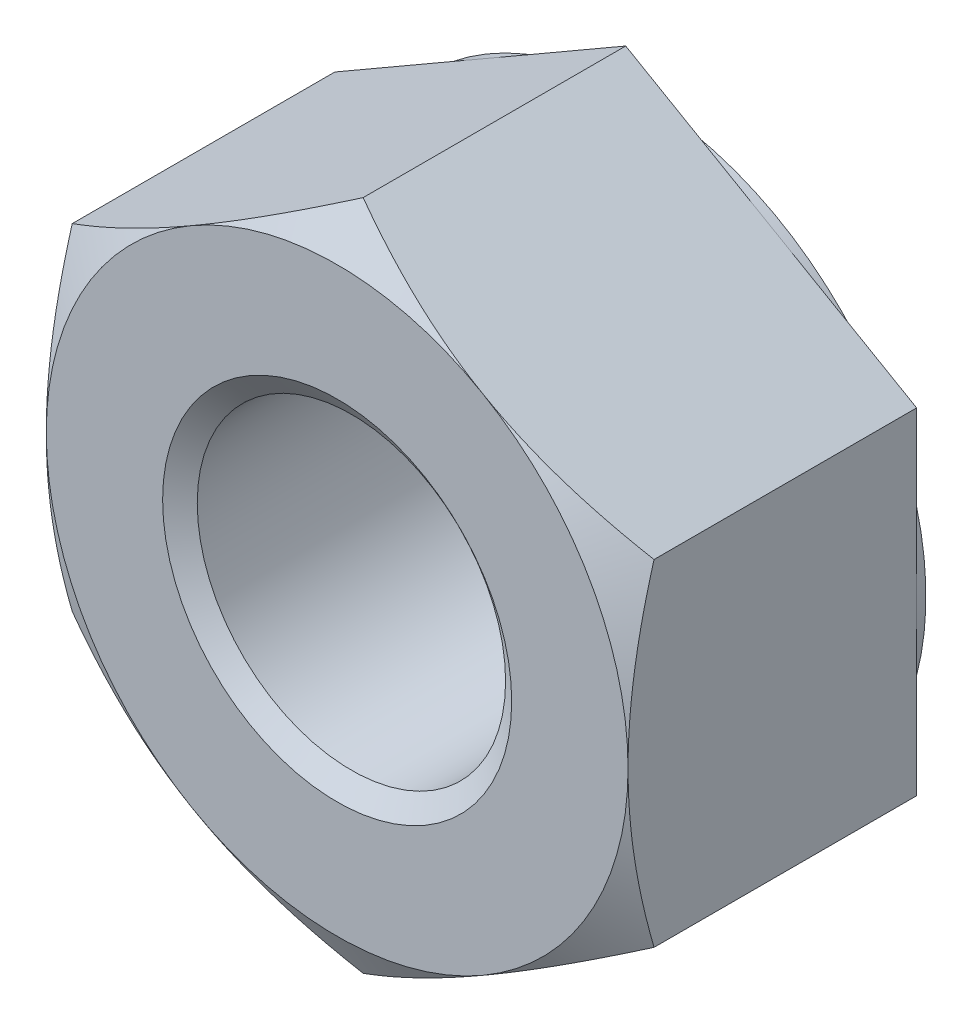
ISO-10303-21;
HEADER;
FILE_DESCRIPTION(('STEP AP214'),'2;1');
FILE_NAME('part.step','',(''),(''),'','','');
FILE_SCHEMA(('AUTOMOTIVE_DESIGN { 1 0 10303 214 1 1 1 1 }'));
ENDSEC;
DATA;
#1=APPLICATION_CONTEXT('core data for automotive mechanical design processes');
#2=APPLICATION_PROTOCOL_DEFINITION('international standard','automotive_design',2000,#1);
#3=PRODUCT_CONTEXT('',#1,'mechanical');
#4=PRODUCT('Part','Part','',(#3));
#5=PRODUCT_RELATED_PRODUCT_CATEGORY('part','',(#4));
#6=PRODUCT_DEFINITION_FORMATION('','',#4);
#7=PRODUCT_DEFINITION_CONTEXT('part definition',#1,'design');
#8=PRODUCT_DEFINITION('design','',#6,#7);
#9=PRODUCT_DEFINITION_SHAPE('','',#8);
#10=(LENGTH_UNIT() NAMED_UNIT(*) SI_UNIT(.MILLI.,.METRE.));
#11=(NAMED_UNIT(*) PLANE_ANGLE_UNIT() SI_UNIT($,.RADIAN.));
#12=(NAMED_UNIT(*) SI_UNIT($,.STERADIAN.) SOLID_ANGLE_UNIT());
#13=UNCERTAINTY_MEASURE_WITH_UNIT(LENGTH_MEASURE(1.E-05),#10,'distance_accuracy_value','');
#14=(GEOMETRIC_REPRESENTATION_CONTEXT(3) GLOBAL_UNCERTAINTY_ASSIGNED_CONTEXT((#13)) GLOBAL_UNIT_ASSIGNED_CONTEXT((#10,
#11,#12)) REPRESENTATION_CONTEXT('',''));
#15=CARTESIAN_POINT('',(0.,0.,0.));
#16=DIRECTION('',(0.,0.,1.));
#17=DIRECTION('',(1.,0.,0.));
#18=AXIS2_PLACEMENT_3D('',#15,#16,#17);
#19=CARTESIAN_POINT('',(0.,0.,-25.6));
#20=DIRECTION('',(0.,0.,1.));
#21=DIRECTION('',(1.,0.,0.));
#22=AXIS2_PLACEMENT_3D('',#19,#20,#21);
#23=CYLINDRICAL_SURFACE('',#22,13.25);
#24=CARTESIAN_POINT('',(0.,0.,-1.22536319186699));
#25=DIRECTION('',(0.,0.,1.));
#26=DIRECTION('',(1.,0.,0.));
#27=AXIS2_PLACEMENT_3D('',#24,#25,#26);
#28=CIRCLE('',#27,13.25);
#29=CARTESIAN_POINT('',(13.25,0.,-1.22536319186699));
#30=VERTEX_POINT('',#29);
#31=EDGE_CURVE('E149',#30,#30,#28,.F.);
#32=ORIENTED_EDGE('',*,*,#31,.F.);
#33=EDGE_LOOP('',(#32));
#34=FACE_BOUND('',#33,.T.);
#35=CARTESIAN_POINT('',(0.,0.,-24.349236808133));
#36=DIRECTION('',(0.,0.,-1.));
#37=DIRECTION('',(-1.,0.,0.));
#38=AXIS2_PLACEMENT_3D('',#35,#36,#37);
#39=CIRCLE('',#38,13.25);
#40=CARTESIAN_POINT('',(-13.25,0.,-24.349236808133));
#41=VERTEX_POINT('',#40);
#42=EDGE_CURVE('E37',#41,#41,#39,.F.);
#43=ORIENTED_EDGE('',*,*,#42,.F.);
#44=EDGE_LOOP('',(#43));
#45=FACE_BOUND('',#44,.T.);
#46=ADVANCED_FACE('F32',(#34,#45),#23,.F.);
#47=CARTESIAN_POINT('',(0.,28.8675134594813,-25.6));
#48=DIRECTION('',(0.,0.,-1.));
#49=DIRECTION('',(-1.,0.,0.));
#50=AXIS2_PLACEMENT_3D('',#47,#48,#49);
#51=PLANE('',#50);
#52=CARTESIAN_POINT('',(0.,0.,-25.6));
#53=DIRECTION('',(0.,0.,-1.));
#54=DIRECTION('',(-1.,0.,0.));
#55=AXIS2_PLACEMENT_3D('',#52,#53,#54);
#56=CIRCLE('',#55,25.);
#57=CARTESIAN_POINT('',(-25.,0.,-25.6));
#58=VERTEX_POINT('',#57);
#59=EDGE_CURVE('E276',#58,#58,#56,.F.);
#60=ORIENTED_EDGE('',*,*,#59,.F.);
#61=EDGE_LOOP('',(#60));
#62=FACE_BOUND('',#61,.T.);
#63=CARTESIAN_POINT('',(0.,0.,-25.6));
#64=DIRECTION('',(0.,0.,-1.));
#65=DIRECTION('',(-1.,0.,0.));
#66=AXIS2_PLACEMENT_3D('',#63,#64,#65);
#67=CIRCLE('',#66,15.);
#68=CARTESIAN_POINT('',(-15.,0.,-25.6));
#69=VERTEX_POINT('',#68);
#70=EDGE_CURVE('E296',#69,#69,#67,.F.);
#71=ORIENTED_EDGE('',*,*,#70,.T.);
#72=EDGE_LOOP('',(#71));
#73=FACE_BOUND('',#72,.T.);
#74=ADVANCED_FACE('F228',(#62,#73),#51,.T.);
#75=CARTESIAN_POINT('',(0.,28.8675134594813,0.));
#76=DIRECTION('',(0.,0.,-1.));
#77=DIRECTION('',(-1.,0.,0.));
#78=AXIS2_PLACEMENT_3D('',#75,#76,#77);
#79=PLANE('',#78);
#80=CARTESIAN_POINT('',(0.,0.,0.));
#81=DIRECTION('',(0.,0.,-1.));
#82=DIRECTION('',(-1.,0.,0.));
#83=AXIS2_PLACEMENT_3D('',#80,#81,#82);
#84=CIRCLE('',#83,25.);
#85=CARTESIAN_POINT('',(-12.5,21.650635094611,0.));
#86=VERTEX_POINT('',#85);
#87=CARTESIAN_POINT('',(-25.,0.,0.));
#88=VERTEX_POINT('',#87);
#89=EDGE_CURVE('E44',#86,#88,#84,.F.);
#90=ORIENTED_EDGE('',*,*,#89,.T.);
#91=CARTESIAN_POINT('',(-12.5,-21.650635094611,0.));
#92=VERTEX_POINT('',#91);
#93=EDGE_CURVE('E12',#88,#92,#84,.F.);
#94=ORIENTED_EDGE('',*,*,#93,.T.);
#95=CARTESIAN_POINT('',(12.5,-21.650635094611,0.));
#96=VERTEX_POINT('',#95);
#97=EDGE_CURVE('E42',#92,#96,#84,.F.);
#98=ORIENTED_EDGE('',*,*,#97,.T.);
#99=CARTESIAN_POINT('',(25.,0.,0.));
#100=VERTEX_POINT('',#99);
#101=EDGE_CURVE('E128',#96,#100,#84,.F.);
#102=ORIENTED_EDGE('',*,*,#101,.T.);
#103=CARTESIAN_POINT('',(0.,0.,0.));
#104=DIRECTION('',(0.,0.,1.));
#105=DIRECTION('',(1.,0.,0.));
#106=AXIS2_PLACEMENT_3D('',#103,#104,#105);
#107=CIRCLE('',#106,25.);
#108=CARTESIAN_POINT('',(12.5,21.650635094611,0.));
#109=VERTEX_POINT('',#108);
#110=EDGE_CURVE('E140',#100,#109,#107,.T.);
#111=ORIENTED_EDGE('',*,*,#110,.T.);
#112=EDGE_CURVE('E155',#109,#86,#84,.F.);
#113=ORIENTED_EDGE('',*,*,#112,.T.);
#114=EDGE_LOOP('',(#90,#94,#98,#102,#111,#113));
#115=FACE_BOUND('',#114,.T.);
#116=CARTESIAN_POINT('',(0.,0.,0.));
#117=DIRECTION('',(0.,0.,1.));
#118=DIRECTION('',(1.,0.,0.));
#119=AXIS2_PLACEMENT_3D('',#116,#117,#118);
#120=CIRCLE('',#119,15.);
#121=CARTESIAN_POINT('',(15.,0.,0.));
#122=VERTEX_POINT('',#121);
#123=EDGE_CURVE('E295',#122,#122,#120,.T.);
#124=ORIENTED_EDGE('',*,*,#123,.F.);
#125=EDGE_LOOP('',(#124));
#126=FACE_BOUND('',#125,.T.);
#127=ADVANCED_FACE('F152',(#115,#126),#79,.F.);
#128=CARTESIAN_POINT('',(0.,28.8675134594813,-25.6));
#129=DIRECTION('',(-0.500000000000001,0.866025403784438,0.));
#130=DIRECTION('',(-0.866025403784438,-0.500000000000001,0.));
#131=AXIS2_PLACEMENT_3D('',#128,#129,#130);
#132=PLANE('',#131);
#133=DIRECTION('',(0.,0.,1.));
#134=VECTOR('',#133,1.);
#135=CARTESIAN_POINT('',(-25.,14.4337567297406,-25.6));
#136=LINE('',#135,#134);
#137=CARTESIAN_POINT('',(-25.,14.4337567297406,-24.8));
#138=VERTEX_POINT('',#137);
#139=CARTESIAN_POINT('',(-25.,14.4337567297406,-2.23290993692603));
#140=VERTEX_POINT('',#139);
#141=EDGE_CURVE('E285',#138,#140,#136,.T.);
#142=ORIENTED_EDGE('',*,*,#141,.T.);
#143=CARTESIAN_POINT('',(-25.0002,14.4336412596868,-2.23297660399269));
#144=CARTESIAN_POINT('',(-24.4507109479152,14.7508889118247,-2.04982704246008));
#145=CARTESIAN_POINT('',(-23.8990785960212,15.0693739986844,-1.87498859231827));
#146=CARTESIAN_POINT('',(-22.7913904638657,15.7088980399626,-1.54424409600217));
#147=CARTESIAN_POINT('',(-22.2353332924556,16.029937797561,-1.38834427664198));
#148=CARTESIAN_POINT('',(-21.1177090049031,16.6751984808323,-1.09756958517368));
#149=CARTESIAN_POINT('',(-20.5561320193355,16.9994251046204,-0.962744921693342));
#150=CARTESIAN_POINT('',(-19.4290997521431,17.6501174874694,-0.717024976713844));
#151=CARTESIAN_POINT('',(-18.8636448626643,17.9765830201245,-0.606127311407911));
#152=CARTESIAN_POINT('',(-17.7433102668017,18.6234085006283,-0.412968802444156));
#153=CARTESIAN_POINT('',(-17.1885136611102,18.9437204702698,-0.330069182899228));
#154=CARTESIAN_POINT('',(-16.0763783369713,19.5858120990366,-0.191065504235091));
#155=CARTESIAN_POINT('',(-15.5190395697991,19.9075917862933,-0.134961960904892));
#156=CARTESIAN_POINT('',(-14.4034258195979,20.5516916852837,-0.0509670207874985));
#157=CARTESIAN_POINT('',(-13.8451527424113,20.8740107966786,-0.0230421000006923));
#158=CARTESIAN_POINT('',(-12.7280914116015,21.518946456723,0.00399507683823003));
#159=CARTESIAN_POINT('',(-12.1693031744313,21.8415629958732,0.00310822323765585));
#160=CARTESIAN_POINT('',(-11.1246404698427,22.4446992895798,-0.0254657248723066));
#161=CARTESIAN_POINT('',(-10.6386915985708,22.725262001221,-0.0496684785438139));
#162=CARTESIAN_POINT('',(-9.66795399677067,23.2857176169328,-0.119404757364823));
#163=CARTESIAN_POINT('',(-9.18316524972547,23.5656105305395,-0.164937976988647));
#164=CARTESIAN_POINT('',(-8.21492701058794,24.1246231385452,-0.276546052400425));
#165=CARTESIAN_POINT('',(-7.73147912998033,24.4037419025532,-0.342639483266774));
#166=CARTESIAN_POINT('',(-6.76689819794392,24.9606429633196,-0.494198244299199));
#167=CARTESIAN_POINT('',(-6.28576513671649,25.2384252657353,-0.579663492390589));
#168=CARTESIAN_POINT('',(-4.8251476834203,26.0817131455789,-0.867310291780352));
#169=CARTESIAN_POINT('',(-3.84981315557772,26.6448227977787,-1.09818903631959));
#170=CARTESIAN_POINT('',(-2.3975824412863,27.4832685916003,-1.49124920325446));
#171=CARTESIAN_POINT('',(-1.91571684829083,27.7614738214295,-1.62991816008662));
#172=CARTESIAN_POINT('',(-0.955318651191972,28.3159599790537,-1.92129458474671));
#173=CARTESIAN_POINT('',(-0.476785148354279,28.5922414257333,-2.07399809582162));
#174=CARTESIAN_POINT('',(0.000200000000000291,28.8676289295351,-2.2329766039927));
#175=B_SPLINE_CURVE_WITH_KNOTS('',3,(#143,#144,#145,#146,#147,#148,#149,#150,#151,#152,#153,
#154,#155,#156,#157,#158,#159,#160,#161,#162,#163,#164,#165,#166,#167,#168,#169,#170,#171,#172,
#173,#174),.UNSPECIFIED.,.F.,.F.,(4,2,2,2,2,2,2,2,2,2,2,2,2,2,2,4),(0.,1.98125159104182,
3.9631528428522,5.94970601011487,7.93606116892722,9.87343019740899,11.8108365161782,
13.7459351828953,15.6809740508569,17.3655086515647,19.0500191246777,20.7360559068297,
22.4220855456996,25.8684114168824,27.588572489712,29.3082500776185),.UNSPECIFIED.);
#176=EDGE_CURVE('E56',#140,#86,#175,.T.);
#177=ORIENTED_EDGE('',*,*,#176,.T.);
#178=CARTESIAN_POINT('',(0.,28.8675134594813,-2.23290993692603));
#179=VERTEX_POINT('',#178);
#180=EDGE_CURVE('E164',#86,#179,#175,.T.);
#181=ORIENTED_EDGE('',*,*,#180,.T.);
#182=DIRECTION('',(0.,0.,1.));
#183=VECTOR('',#182,1.);
#184=CARTESIAN_POINT('',(0.,28.8675134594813,-25.6));
#185=LINE('',#184,#183);
#186=CARTESIAN_POINT('',(0.,28.8675134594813,-24.8));
#187=VERTEX_POINT('',#186);
#188=EDGE_CURVE('E273',#187,#179,#185,.T.);
#189=ORIENTED_EDGE('',*,*,#188,.F.);
#190=DIRECTION('',(-0.866025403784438,-0.500000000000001,0.));
#191=VECTOR('',#190,1.);
#192=CARTESIAN_POINT('',(0.,28.8675134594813,-24.8));
#193=LINE('',#192,#191);
#194=CARTESIAN_POINT('',(-12.5,21.650635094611,-24.8));
#195=VERTEX_POINT('',#194);
#196=EDGE_CURVE('E261',#187,#195,#193,.T.);
#197=ORIENTED_EDGE('',*,*,#196,.T.);
#198=EDGE_CURVE('E257',#195,#138,#193,.T.);
#199=ORIENTED_EDGE('',*,*,#198,.T.);
#200=EDGE_LOOP('',(#142,#177,#181,#189,#197,#199));
#201=FACE_BOUND('',#200,.T.);
#202=ADVANCED_FACE('F34',(#201),#132,.T.);
#203=CARTESIAN_POINT('',(25.,14.4337567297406,-25.6));
#204=DIRECTION('',(0.500000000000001,0.866025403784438,0.));
#205=DIRECTION('',(-0.866025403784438,0.500000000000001,0.));
#206=AXIS2_PLACEMENT_3D('',#203,#204,#205);
#207=PLANE('',#206);
#208=ORIENTED_EDGE('',*,*,#188,.T.);
#209=CARTESIAN_POINT('',(-0.00020000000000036,28.8676289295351,-2.2329766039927));
#210=CARTESIAN_POINT('',(0.54928905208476,28.5503812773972,-2.04982704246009));
#211=CARTESIAN_POINT('',(1.10092140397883,28.2318961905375,-1.87498859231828));
#212=CARTESIAN_POINT('',(2.20860953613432,27.5923721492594,-1.54424409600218));
#213=CARTESIAN_POINT('',(2.76466670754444,27.2713323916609,-1.38834427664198));
#214=CARTESIAN_POINT('',(3.88229099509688,26.6260717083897,-1.09756958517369));
#215=CARTESIAN_POINT('',(4.44386798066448,26.3018450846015,-0.96274492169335));
#216=CARTESIAN_POINT('',(5.57090024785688,25.6511527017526,-0.71702497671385));
#217=CARTESIAN_POINT('',(6.13635513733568,25.3246871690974,-0.606127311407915));
#218=CARTESIAN_POINT('',(7.25668973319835,24.6778616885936,-0.412968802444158));
#219=CARTESIAN_POINT('',(7.81148633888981,24.3575497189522,-0.33006918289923));
#220=CARTESIAN_POINT('',(8.92362166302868,23.7154580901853,-0.191065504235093));
#221=CARTESIAN_POINT('',(9.48096043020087,23.3936784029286,-0.134961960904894));
#222=CARTESIAN_POINT('',(10.5965741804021,22.7495785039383,-0.0509670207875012));
#223=CARTESIAN_POINT('',(11.1548472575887,22.4272593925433,-0.0230421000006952));
#224=CARTESIAN_POINT('',(12.2719085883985,21.7823237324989,0.00399507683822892));
#225=CARTESIAN_POINT('',(12.8306968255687,21.4597071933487,0.00310822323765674));
#226=CARTESIAN_POINT('',(13.8753595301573,20.8565708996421,-0.0254657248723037));
#227=CARTESIAN_POINT('',(14.3613084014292,20.5760081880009,-0.0496684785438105));
#228=CARTESIAN_POINT('',(15.3320460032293,20.0155525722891,-0.11940475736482));
#229=CARTESIAN_POINT('',(15.8168347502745,19.7356596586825,-0.164937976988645));
#230=CARTESIAN_POINT('',(16.7850729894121,19.1766470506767,-0.276546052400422));
#231=CARTESIAN_POINT('',(17.2685208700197,18.8975282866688,-0.342639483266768));
#232=CARTESIAN_POINT('',(18.2331018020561,18.3406272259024,-0.494198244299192));
#233=CARTESIAN_POINT('',(18.7142348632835,18.0628449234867,-0.579663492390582));
#234=CARTESIAN_POINT('',(20.1748523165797,17.219557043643,-0.867310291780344));
#235=CARTESIAN_POINT('',(21.1501868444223,16.6564473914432,-1.09818903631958));
#236=CARTESIAN_POINT('',(22.6024175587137,15.8180015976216,-1.49124920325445));
#237=CARTESIAN_POINT('',(23.0842831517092,15.5397963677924,-1.62991816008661));
#238=CARTESIAN_POINT('',(24.044681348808,14.9853102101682,-1.92129458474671));
#239=CARTESIAN_POINT('',(24.5232148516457,14.7090287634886,-2.07399809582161));
#240=CARTESIAN_POINT('',(25.0002,14.4336412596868,-2.23297660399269));
#241=B_SPLINE_CURVE_WITH_KNOTS('',3,(#209,#210,#211,#212,#213,#214,#215,#216,#217,#218,#219,
#220,#221,#222,#223,#224,#225,#226,#227,#228,#229,#230,#231,#232,#233,#234,#235,#236,#237,#238,
#239,#240),.UNSPECIFIED.,.F.,.F.,(4,2,2,2,2,2,2,2,2,2,2,2,2,2,2,4),(0.,1.98125159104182,
3.96315284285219,5.94970601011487,7.93606116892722,9.873430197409,11.8108365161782,
13.7459351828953,15.6809740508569,17.3655086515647,19.0500191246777,20.7360559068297,
22.4220855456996,25.8684114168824,27.588572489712,29.3082500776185),.UNSPECIFIED.);
#242=EDGE_CURVE('E161',#179,#109,#241,.T.);
#243=ORIENTED_EDGE('',*,*,#242,.T.);
#244=CARTESIAN_POINT('',(25.,14.4337567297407,-2.23290993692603));
#245=VERTEX_POINT('',#244);
#246=EDGE_CURVE('E143',#109,#245,#241,.T.);
#247=ORIENTED_EDGE('',*,*,#246,.T.);
#248=DIRECTION('',(0.,0.,1.));
#249=VECTOR('',#248,1.);
#250=CARTESIAN_POINT('',(25.,14.4337567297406,-25.6));
#251=LINE('',#250,#249);
#252=CARTESIAN_POINT('',(25.,14.4337567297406,-24.8));
#253=VERTEX_POINT('',#252);
#254=EDGE_CURVE('E160',#253,#245,#251,.T.);
#255=ORIENTED_EDGE('',*,*,#254,.F.);
#256=DIRECTION('',(-0.866025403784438,0.500000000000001,0.));
#257=VECTOR('',#256,1.);
#258=CARTESIAN_POINT('',(25.,14.4337567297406,-24.8));
#259=LINE('',#258,#257);
#260=CARTESIAN_POINT('',(12.5,21.650635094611,-24.8));
#261=VERTEX_POINT('',#260);
#262=EDGE_CURVE('E269',#253,#261,#259,.T.);
#263=ORIENTED_EDGE('',*,*,#262,.T.);
#264=EDGE_CURVE('E265',#261,#187,#259,.T.);
#265=ORIENTED_EDGE('',*,*,#264,.T.);
#266=EDGE_LOOP('',(#208,#243,#247,#255,#263,#265));
#267=FACE_BOUND('',#266,.T.);
#268=ADVANCED_FACE('F241',(#267),#207,.T.);
#269=CARTESIAN_POINT('',(25.,14.4337567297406,-25.6));
#270=DIRECTION('',(-1.,0.,0.));
#271=DIRECTION('',(0.,0.,1.));
#272=AXIS2_PLACEMENT_3D('',#269,#270,#271);
#273=PLANE('',#272);
#274=CARTESIAN_POINT('',(25.,-38.2804499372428,-11.9631676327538));
#275=CARTESIAN_POINT('',(25.,-37.7316499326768,-11.6978883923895));
#276=CARTESIAN_POINT('',(25.,-37.1821861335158,-11.4339780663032));
#277=CARTESIAN_POINT('',(25.,-36.0817917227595,-10.9092184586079));
#278=CARTESIAN_POINT('',(25.,-35.5308610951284,-10.6483692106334));
#279=CARTESIAN_POINT('',(25.,-34.4273122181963,-10.1300168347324));
#280=CARTESIAN_POINT('',(25.,-33.8746936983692,-9.87251428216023));
#281=CARTESIAN_POINT('',(25.,-32.7677130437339,-9.36129024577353));
#282=CARTESIAN_POINT('',(25.,-32.2133509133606,-9.10756875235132));
#283=CARTESIAN_POINT('',(25.,-30.5410458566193,-8.34982894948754));
#284=CARTESIAN_POINT('',(25.,-29.4201910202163,-7.85220922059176));
#285=CARTESIAN_POINT('',(25.,-27.1692649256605,-6.87831444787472));
#286=CARTESIAN_POINT('',(25.,-26.0391941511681,-6.40203829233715));
#287=CARTESIAN_POINT('',(25.,-24.32880965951,-5.70514245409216));
#288=CARTESIAN_POINT('',(25.,-23.7526064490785,-5.47442383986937));
#289=CARTESIAN_POINT('',(25.,-22.5971033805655,-5.02088611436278));
#290=CARTESIAN_POINT('',(25.,-22.0178035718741,-4.79806687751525));
#291=CARTESIAN_POINT('',(25.,-20.8557495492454,-4.36134677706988));
#292=CARTESIAN_POINT('',(25.,-20.272994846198,-4.14744721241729));
#293=CARTESIAN_POINT('',(25.,-19.1038614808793,-3.72982042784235));
#294=CARTESIAN_POINT('',(25.,-18.5174829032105,-3.52609297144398));
#295=CARTESIAN_POINT('',(25.,-17.3420830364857,-3.13060347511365));
#296=CARTESIAN_POINT('',(25.,-16.7530700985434,-2.93881673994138));
#297=CARTESIAN_POINT('',(25.,-15.5709669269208,-2.56828916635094));
#298=CARTESIAN_POINT('',(25.,-14.977876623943,-2.38954855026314));
#299=CARTESIAN_POINT('',(25.,-13.1924952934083,-1.87551775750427));
#300=CARTESIAN_POINT('',(25.,-11.9936409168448,-1.56226357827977));
#301=CARTESIAN_POINT('',(25.,-10.1825070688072,-1.14803124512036));
#302=CARTESIAN_POINT('',(25.,-9.57652516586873,-1.01920742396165));
#303=CARTESIAN_POINT('',(25.,-8.3605229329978,-0.782143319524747));
#304=CARTESIAN_POINT('',(25.,-7.75050269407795,-0.673902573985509));
#305=CARTESIAN_POINT('',(25.,-6.52683986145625,-0.479923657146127));
#306=CARTESIAN_POINT('',(25.,-5.91319704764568,-0.394186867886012));
#307=CARTESIAN_POINT('',(25.,-4.68299042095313,-0.24693789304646));
#308=CARTESIAN_POINT('',(25.,-4.06642660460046,-0.185425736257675));
#309=CARTESIAN_POINT('',(25.,-2.83519170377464,-0.0882820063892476));
#310=CARTESIAN_POINT('',(25.,-2.22053347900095,-0.0524884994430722));
#311=CARTESIAN_POINT('',(25.,-0.990255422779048,-0.00697026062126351));
#312=CARTESIAN_POINT('',(25.,-0.374635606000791,0.00275486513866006));
#313=CARTESIAN_POINT('',(25.,0.856289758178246,-0.00409423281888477));
#314=CARTESIAN_POINT('',(25.,1.47159534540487,-0.0206611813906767));
#315=CARTESIAN_POINT('',(25.,2.70096822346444,-0.0796827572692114));
#316=CARTESIAN_POINT('',(25.,3.3150354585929,-0.122138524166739));
#317=CARTESIAN_POINT('',(25.,4.80288756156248,-0.255485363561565));
#318=CARTESIAN_POINT('',(25.,5.67553126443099,-0.35932099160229));
#319=CARTESIAN_POINT('',(25.,7.4140279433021,-0.613499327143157));
#320=CARTESIAN_POINT('',(25.,8.27987989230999,-0.76384893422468));
#321=CARTESIAN_POINT('',(25.,10.0052343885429,-1.10594067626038));
#322=CARTESIAN_POINT('',(25.,10.8647191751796,-1.29777154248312));
#323=CARTESIAN_POINT('',(25.,12.5748892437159,-1.71686905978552));
#324=CARTESIAN_POINT('',(25.,13.4255748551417,-1.94413437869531));
#325=CARTESIAN_POINT('',(25.,15.1381801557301,-2.43434337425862));
#326=CARTESIAN_POINT('',(25.,15.9998944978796,-2.69799959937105));
#327=CARTESIAN_POINT('',(25.,17.7148811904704,-3.2515617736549));
#328=CARTESIAN_POINT('',(25.,18.568152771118,-3.54147009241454));
#329=CARTESIAN_POINT('',(25.,20.2621507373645,-4.14140384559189));
#330=CARTESIAN_POINT('',(25.,21.1029207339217,-4.45130661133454));
#331=CARTESIAN_POINT('',(25.,22.3587743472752,-4.92957644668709));
#332=CARTESIAN_POINT('',(25.,22.7764420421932,-5.09120865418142));
#333=CARTESIAN_POINT('',(25.,23.6101513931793,-5.41858120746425));
#334=CARTESIAN_POINT('',(25.,24.0261930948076,-5.58432143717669));
#335=CARTESIAN_POINT('',(25.,24.4414811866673,-5.75193129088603));
#336=B_SPLINE_CURVE_WITH_KNOTS('',3,(#274,#275,#276,#277,#278,#279,#280,#281,#282,#283,#284,
#285,#286,#287,#288,#289,#290,#291,#292,#293,#294,#295,#296,#297,#298,#299,#300,#301,#302,#303,
#304,#305,#306,#307,#308,#309,#310,#311,#312,#313,#314,#315,#316,#317,#318,#319,#320,#321,#322,
#323,#324,#325,#326,#327,#328,#329,#330,#331,#332,#333,#334,#335),.UNSPECIFIED.,.F.,.F.,(4,2,2,
2,2,2,2,2,2,2,2,2,2,2,2,2,2,2,2,2,2,2,2,2,2,2,2,2,2,2,4),(0.,1.82865894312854,3.65733796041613,
5.48632730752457,7.31531200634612,10.9941976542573,14.6728914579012,16.534878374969,
18.3968356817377,20.2590631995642,22.1212474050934,23.9794428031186,25.837669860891,
29.5526890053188,31.4109790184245,33.269227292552,35.1275896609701,36.9859542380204,
38.83251283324,40.6790435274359,42.5250633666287,44.3711644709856,47.006096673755,
49.6414199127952,52.28243705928,54.9233549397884,57.6262936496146,60.3294765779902,
63.017415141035,64.3609532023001,65.7044533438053),.UNSPECIFIED.);
#337=CARTESIAN_POINT('',(25.,-14.4337567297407,-2.23290993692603));
#338=VERTEX_POINT('',#337);
#339=EDGE_CURVE('E124',#338,#100,#336,.T.);
#340=ORIENTED_EDGE('',*,*,#339,.F.);
#341=DIRECTION('',(0.,0.,1.));
#342=VECTOR('',#341,1.);
#343=CARTESIAN_POINT('',(25.,-14.4337567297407,-25.6));
#344=LINE('',#343,#342);
#345=CARTESIAN_POINT('',(25.,-14.4337567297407,-24.8));
#346=VERTEX_POINT('',#345);
#347=EDGE_CURVE('E278',#346,#338,#344,.T.);
#348=ORIENTED_EDGE('',*,*,#347,.F.);
#349=DIRECTION('',(0.,-1.,0.));
#350=VECTOR('',#349,1.);
#351=CARTESIAN_POINT('',(25.,14.4337567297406,-24.8));
#352=LINE('',#351,#350);
#353=CARTESIAN_POINT('',(25.,0.,-24.8));
#354=VERTEX_POINT('',#353);
#355=EDGE_CURVE('E270',#354,#346,#352,.T.);
#356=ORIENTED_EDGE('',*,*,#355,.F.);
#357=EDGE_CURVE('E272',#253,#354,#352,.T.);
#358=ORIENTED_EDGE('',*,*,#357,.F.);
#359=ORIENTED_EDGE('',*,*,#254,.T.);
#360=EDGE_CURVE('E137',#100,#245,#336,.T.);
#361=ORIENTED_EDGE('',*,*,#360,.F.);
#362=EDGE_LOOP('',(#340,#348,#356,#358,#359,#361));
#363=FACE_BOUND('',#362,.T.);
#364=ADVANCED_FACE('F157',(#363),#273,.F.);
#365=CARTESIAN_POINT('',(0.,-28.8675134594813,-25.6));
#366=DIRECTION('',(0.5,-0.866025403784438,0.));
#367=DIRECTION('',(0.866025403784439,0.5,0.));
#368=AXIS2_PLACEMENT_3D('',#365,#366,#367);
#369=PLANE('',#368);
#370=ORIENTED_EDGE('',*,*,#347,.T.);
#371=CARTESIAN_POINT('',(25.0002,-14.4336412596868,-2.2329766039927));
#372=CARTESIAN_POINT('',(24.4507109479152,-14.7508889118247,-2.04982704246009));
#373=CARTESIAN_POINT('',(23.8990785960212,-15.0693739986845,-1.87498859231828));
#374=CARTESIAN_POINT('',(22.7913904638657,-15.7088980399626,-1.54424409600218));
#375=CARTESIAN_POINT('',(22.2353332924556,-16.029937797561,-1.38834427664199));
#376=CARTESIAN_POINT('',(21.1177090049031,-16.6751984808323,-1.09756958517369));
#377=CARTESIAN_POINT('',(20.5561320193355,-16.9994251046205,-0.962744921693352));
#378=CARTESIAN_POINT('',(19.4290997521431,-17.6501174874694,-0.717024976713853));
#379=CARTESIAN_POINT('',(18.8636448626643,-17.9765830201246,-0.606127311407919));
#380=CARTESIAN_POINT('',(17.7433102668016,-18.6234085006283,-0.412968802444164));
#381=CARTESIAN_POINT('',(17.1885136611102,-18.9437204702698,-0.330069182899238));
#382=CARTESIAN_POINT('',(16.0763783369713,-19.5858120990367,-0.191065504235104));
#383=CARTESIAN_POINT('',(15.5190395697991,-19.9075917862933,-0.134961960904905));
#384=CARTESIAN_POINT('',(14.4034258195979,-20.5516916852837,-0.0509670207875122));
#385=CARTESIAN_POINT('',(13.8451527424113,-20.8740107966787,-0.0230421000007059));
#386=CARTESIAN_POINT('',(12.7280914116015,-21.5189464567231,0.00399507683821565));
#387=CARTESIAN_POINT('',(12.1693031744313,-21.8415629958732,0.00310822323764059));
#388=CARTESIAN_POINT('',(11.1246404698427,-22.4446992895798,-0.0254657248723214));
#389=CARTESIAN_POINT('',(10.6386915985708,-22.7252620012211,-0.0496684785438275));
#390=CARTESIAN_POINT('',(9.66795399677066,-23.2857176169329,-0.119404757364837));
#391=CARTESIAN_POINT('',(9.18316524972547,-23.5656105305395,-0.164937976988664));
#392=CARTESIAN_POINT('',(8.21492701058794,-24.1246231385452,-0.276546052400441));
#393=CARTESIAN_POINT('',(7.73147912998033,-24.4037419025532,-0.342639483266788));
#394=CARTESIAN_POINT('',(6.76689819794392,-24.9606429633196,-0.494198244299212));
#395=CARTESIAN_POINT('',(6.28576513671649,-25.2384252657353,-0.579663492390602));
#396=CARTESIAN_POINT('',(4.8251476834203,-26.0817131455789,-0.867310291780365));
#397=CARTESIAN_POINT('',(3.84981315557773,-26.6448227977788,-1.0981890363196));
#398=CARTESIAN_POINT('',(2.39758244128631,-27.4832685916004,-1.49124920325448));
#399=CARTESIAN_POINT('',(1.91571684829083,-27.7614738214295,-1.62991816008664));
#400=CARTESIAN_POINT('',(0.955318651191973,-28.3159599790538,-1.92129458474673));
#401=CARTESIAN_POINT('',(0.476785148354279,-28.5922414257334,-2.07399809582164));
#402=CARTESIAN_POINT('',(-0.000200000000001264,-28.8676289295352,-2.23297660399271));
#403=B_SPLINE_CURVE_WITH_KNOTS('',3,(#371,#372,#373,#374,#375,#376,#377,#378,#379,#380,#381,
#382,#383,#384,#385,#386,#387,#388,#389,#390,#391,#392,#393,#394,#395,#396,#397,#398,#399,#400,
#401,#402),.UNSPECIFIED.,.F.,.F.,(4,2,2,2,2,2,2,2,2,2,2,2,2,2,2,4),(0.,1.98125159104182,
3.9631528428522,5.94970601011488,7.93606116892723,9.873430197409,11.8108365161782,
13.7459351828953,15.6809740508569,17.3655086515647,19.0500191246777,20.7360559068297,
22.4220855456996,25.8684114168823,27.5885724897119,29.3082500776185),.UNSPECIFIED.);
#404=EDGE_CURVE('E131',#338,#96,#403,.T.);
#405=ORIENTED_EDGE('',*,*,#404,.T.);
#406=CARTESIAN_POINT('',(0.,-28.8675134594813,-2.23290993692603));
#407=VERTEX_POINT('',#406);
#408=EDGE_CURVE('E171',#96,#407,#403,.T.);
#409=ORIENTED_EDGE('',*,*,#408,.T.);
#410=DIRECTION('',(0.,0.,1.));
#411=VECTOR('',#410,1.);
#412=CARTESIAN_POINT('',(0.,-28.8675134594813,-25.6));
#413=LINE('',#412,#411);
#414=CARTESIAN_POINT('',(0.,-28.8675134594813,-24.8));
#415=VERTEX_POINT('',#414);
#416=EDGE_CURVE('E280',#415,#407,#413,.T.);
#417=ORIENTED_EDGE('',*,*,#416,.F.);
#418=DIRECTION('',(0.866025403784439,0.5,0.));
#419=VECTOR('',#418,1.);
#420=CARTESIAN_POINT('',(0.,-28.8675134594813,-24.8));
#421=LINE('',#420,#419);
#422=CARTESIAN_POINT('',(12.5,-21.650635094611,-24.8));
#423=VERTEX_POINT('',#422);
#424=EDGE_CURVE('E262',#415,#423,#421,.T.);
#425=ORIENTED_EDGE('',*,*,#424,.T.);
#426=EDGE_CURVE('E266',#423,#346,#421,.T.);
#427=ORIENTED_EDGE('',*,*,#426,.T.);
#428=EDGE_LOOP('',(#370,#405,#409,#417,#425,#427));
#429=FACE_BOUND('',#428,.T.);
#430=ADVANCED_FACE('F214',(#429),#369,.T.);
#431=CARTESIAN_POINT('',(-25.,-14.4337567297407,-25.6));
#432=DIRECTION('',(-0.5,-0.866025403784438,0.));
#433=DIRECTION('',(0.866025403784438,-0.5,0.));
#434=AXIS2_PLACEMENT_3D('',#431,#432,#433);
#435=PLANE('',#434);
#436=ORIENTED_EDGE('',*,*,#416,.T.);
#437=CARTESIAN_POINT('',(0.000199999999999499,-28.8676289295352,-2.23297660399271));
#438=CARTESIAN_POINT('',(-0.549289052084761,-28.5503812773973,-2.0498270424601));
#439=CARTESIAN_POINT('',(-1.10092140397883,-28.2318961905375,-1.87498859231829));
#440=CARTESIAN_POINT('',(-2.20860953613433,-27.5923721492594,-1.54424409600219));
#441=CARTESIAN_POINT('',(-2.76466670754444,-27.2713323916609,-1.388344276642));
#442=CARTESIAN_POINT('',(-3.88229099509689,-26.6260717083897,-1.0975695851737));
#443=CARTESIAN_POINT('',(-4.44386798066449,-26.3018450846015,-0.962744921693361));
#444=CARTESIAN_POINT('',(-5.57090024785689,-25.6511527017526,-0.717024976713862));
#445=CARTESIAN_POINT('',(-6.13635513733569,-25.3246871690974,-0.606127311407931));
#446=CARTESIAN_POINT('',(-7.25668973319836,-24.6778616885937,-0.412968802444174));
#447=CARTESIAN_POINT('',(-7.81148633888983,-24.3575497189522,-0.330069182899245));
#448=CARTESIAN_POINT('',(-8.92362166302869,-23.7154580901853,-0.191065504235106));
#449=CARTESIAN_POINT('',(-9.48096043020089,-23.3936784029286,-0.134961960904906));
#450=CARTESIAN_POINT('',(-10.5965741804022,-22.7495785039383,-0.0509670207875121));
#451=CARTESIAN_POINT('',(-11.1548472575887,-22.4272593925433,-0.0230421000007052));
#452=CARTESIAN_POINT('',(-12.2719085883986,-21.7823237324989,0.00399507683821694));
#453=CARTESIAN_POINT('',(-12.8306968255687,-21.4597071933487,0.00310822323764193));
#454=CARTESIAN_POINT('',(-13.8753595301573,-20.8565708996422,-0.0254657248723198));
#455=CARTESIAN_POINT('',(-14.3613084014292,-20.5760081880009,-0.0496684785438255));
#456=CARTESIAN_POINT('',(-15.3320460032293,-20.0155525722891,-0.119404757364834));
#457=CARTESIAN_POINT('',(-15.8168347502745,-19.7356596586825,-0.16493797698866));
#458=CARTESIAN_POINT('',(-16.7850729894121,-19.1766470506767,-0.276546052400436));
#459=CARTESIAN_POINT('',(-17.2685208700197,-18.8975282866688,-0.342639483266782));
#460=CARTESIAN_POINT('',(-18.2331018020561,-18.3406272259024,-0.494198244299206));
#461=CARTESIAN_POINT('',(-18.7142348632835,-18.0628449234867,-0.579663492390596));
#462=CARTESIAN_POINT('',(-20.1748523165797,-17.2195570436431,-0.867310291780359));
#463=CARTESIAN_POINT('',(-21.1501868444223,-16.6564473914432,-1.09818903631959));
#464=CARTESIAN_POINT('',(-22.6024175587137,-15.8180015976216,-1.49124920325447));
#465=CARTESIAN_POINT('',(-23.0842831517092,-15.5397963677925,-1.62991816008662));
#466=CARTESIAN_POINT('',(-24.044681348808,-14.9853102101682,-1.92129458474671));
#467=CARTESIAN_POINT('',(-24.5232148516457,-14.7090287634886,-2.07399809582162));
#468=CARTESIAN_POINT('',(-25.0002,-14.4336412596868,-2.2329766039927));
#469=B_SPLINE_CURVE_WITH_KNOTS('',3,(#437,#438,#439,#440,#441,#442,#443,#444,#445,#446,#447,
#448,#449,#450,#451,#452,#453,#454,#455,#456,#457,#458,#459,#460,#461,#462,#463,#464,#465,#466,
#467,#468),.UNSPECIFIED.,.F.,.F.,(4,2,2,2,2,2,2,2,2,2,2,2,2,2,2,4),(0.,1.98125159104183,
3.9631528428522,5.94970601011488,7.93606116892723,9.87343019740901,11.8108365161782,
13.7459351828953,15.6809740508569,17.3655086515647,19.0500191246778,20.7360559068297,
22.4220855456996,25.8684114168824,27.588572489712,29.3082500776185),.UNSPECIFIED.);
#470=EDGE_CURVE('E208',#407,#92,#469,.T.);
#471=ORIENTED_EDGE('',*,*,#470,.T.);
#472=CARTESIAN_POINT('',(-25.,-14.4337567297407,-2.23290993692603));
#473=VERTEX_POINT('',#472);
#474=EDGE_CURVE('E201',#92,#473,#469,.T.);
#475=ORIENTED_EDGE('',*,*,#474,.T.);
#476=DIRECTION('',(0.,0.,1.));
#477=VECTOR('',#476,1.);
#478=CARTESIAN_POINT('',(-25.,-14.4337567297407,-25.6));
#479=LINE('',#478,#477);
#480=CARTESIAN_POINT('',(-25.,-14.4337567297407,-24.8));
#481=VERTEX_POINT('',#480);
#482=EDGE_CURVE('E283',#481,#473,#479,.T.);
#483=ORIENTED_EDGE('',*,*,#482,.F.);
#484=DIRECTION('',(0.866025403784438,-0.5,0.));
#485=VECTOR('',#484,1.);
#486=CARTESIAN_POINT('',(-25.,-14.4337567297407,-24.8));
#487=LINE('',#486,#485);
#488=CARTESIAN_POINT('',(-12.5,-21.650635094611,-24.8));
#489=VERTEX_POINT('',#488);
#490=EDGE_CURVE('E252',#481,#489,#487,.T.);
#491=ORIENTED_EDGE('',*,*,#490,.T.);
#492=EDGE_CURVE('E258',#489,#415,#487,.T.);
#493=ORIENTED_EDGE('',*,*,#492,.T.);
#494=EDGE_LOOP('',(#436,#471,#475,#483,#491,#493));
#495=FACE_BOUND('',#494,.T.);
#496=ADVANCED_FACE('F210',(#495),#435,.T.);
#497=CARTESIAN_POINT('',(-25.,14.4337567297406,-25.6));
#498=DIRECTION('',(-1.,0.,0.));
#499=DIRECTION('',(0.,0.,1.));
#500=AXIS2_PLACEMENT_3D('',#497,#498,#499);
#501=PLANE('',#500);
#502=ORIENTED_EDGE('',*,*,#482,.T.);
#503=CARTESIAN_POINT('',(-25.,-38.2804499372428,-11.9631676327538));
#504=CARTESIAN_POINT('',(-25.,-37.7316499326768,-11.6978883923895));
#505=CARTESIAN_POINT('',(-25.,-37.1821861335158,-11.4339780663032));
#506=CARTESIAN_POINT('',(-25.,-36.0817917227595,-10.9092184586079));
#507=CARTESIAN_POINT('',(-25.,-35.5308610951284,-10.6483692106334));
#508=CARTESIAN_POINT('',(-25.,-34.4273122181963,-10.1300168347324));
#509=CARTESIAN_POINT('',(-25.,-33.8746936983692,-9.87251428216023));
#510=CARTESIAN_POINT('',(-25.,-32.7677130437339,-9.36129024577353));
#511=CARTESIAN_POINT('',(-25.,-32.2133509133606,-9.10756875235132));
#512=CARTESIAN_POINT('',(-25.,-30.5410458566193,-8.34982894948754));
#513=CARTESIAN_POINT('',(-25.,-29.4201910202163,-7.85220922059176));
#514=CARTESIAN_POINT('',(-25.,-27.1692649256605,-6.87831444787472));
#515=CARTESIAN_POINT('',(-25.,-26.0391941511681,-6.40203829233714));
#516=CARTESIAN_POINT('',(-25.,-24.32880965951,-5.70514245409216));
#517=CARTESIAN_POINT('',(-25.,-23.7526064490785,-5.47442383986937));
#518=CARTESIAN_POINT('',(-25.,-22.5971033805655,-5.02088611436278));
#519=CARTESIAN_POINT('',(-25.,-22.0178035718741,-4.79806687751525));
#520=CARTESIAN_POINT('',(-25.,-20.8557495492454,-4.36134677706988));
#521=CARTESIAN_POINT('',(-25.,-20.272994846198,-4.14744721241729));
#522=CARTESIAN_POINT('',(-25.,-19.1038614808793,-3.72982042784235));
#523=CARTESIAN_POINT('',(-25.,-18.5174829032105,-3.52609297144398));
#524=CARTESIAN_POINT('',(-25.,-17.3420830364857,-3.13060347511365));
#525=CARTESIAN_POINT('',(-25.,-16.7530700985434,-2.93881673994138));
#526=CARTESIAN_POINT('',(-25.,-15.5709669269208,-2.56828916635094));
#527=CARTESIAN_POINT('',(-25.,-14.977876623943,-2.38954855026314));
#528=CARTESIAN_POINT('',(-25.,-13.1924952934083,-1.87551775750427));
#529=CARTESIAN_POINT('',(-25.,-11.9936409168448,-1.56226357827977));
#530=CARTESIAN_POINT('',(-25.,-10.1825070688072,-1.14803124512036));
#531=CARTESIAN_POINT('',(-25.,-9.57652516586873,-1.01920742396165));
#532=CARTESIAN_POINT('',(-25.,-8.3605229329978,-0.782143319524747));
#533=CARTESIAN_POINT('',(-25.,-7.75050269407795,-0.673902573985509));
#534=CARTESIAN_POINT('',(-25.,-6.52683986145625,-0.479923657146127));
#535=CARTESIAN_POINT('',(-25.,-5.91319704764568,-0.394186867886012));
#536=CARTESIAN_POINT('',(-25.,-4.68299042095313,-0.24693789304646));
#537=CARTESIAN_POINT('',(-25.,-4.06642660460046,-0.185425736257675));
#538=CARTESIAN_POINT('',(-25.,-2.83519170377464,-0.0882820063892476));
#539=CARTESIAN_POINT('',(-25.,-2.22053347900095,-0.0524884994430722));
#540=CARTESIAN_POINT('',(-25.,-0.990255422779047,-0.00697026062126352));
#541=CARTESIAN_POINT('',(-25.,-0.374635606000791,0.00275486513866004));
#542=CARTESIAN_POINT('',(-25.,0.856289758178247,-0.00409423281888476));
#543=CARTESIAN_POINT('',(-25.,1.47159534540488,-0.0206611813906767));
#544=CARTESIAN_POINT('',(-25.,2.70096822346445,-0.0796827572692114));
#545=CARTESIAN_POINT('',(-25.,3.3150354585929,-0.122138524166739));
#546=CARTESIAN_POINT('',(-25.,4.80288756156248,-0.255485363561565));
#547=CARTESIAN_POINT('',(-25.,5.675531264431,-0.35932099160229));
#548=CARTESIAN_POINT('',(-25.,7.41402794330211,-0.613499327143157));
#549=CARTESIAN_POINT('',(-25.,8.27987989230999,-0.763848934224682));
#550=CARTESIAN_POINT('',(-25.,10.0052343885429,-1.10594067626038));
#551=CARTESIAN_POINT('',(-25.,10.8647191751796,-1.29777154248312));
#552=CARTESIAN_POINT('',(-25.,12.5748892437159,-1.71686905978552));
#553=CARTESIAN_POINT('',(-25.,13.4255748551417,-1.94413437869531));
#554=CARTESIAN_POINT('',(-25.,15.1381801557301,-2.43434337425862));
#555=CARTESIAN_POINT('',(-25.,15.9998944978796,-2.69799959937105));
#556=CARTESIAN_POINT('',(-25.,17.7148811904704,-3.2515617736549));
#557=CARTESIAN_POINT('',(-25.,18.568152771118,-3.54147009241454));
#558=CARTESIAN_POINT('',(-25.,20.2621507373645,-4.14140384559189));
#559=CARTESIAN_POINT('',(-25.,21.1029207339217,-4.45130661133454));
#560=CARTESIAN_POINT('',(-25.,22.3587743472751,-4.92957644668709));
#561=CARTESIAN_POINT('',(-25.,22.7764420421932,-5.09120865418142));
#562=CARTESIAN_POINT('',(-25.,23.6101513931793,-5.41858120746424));
#563=CARTESIAN_POINT('',(-25.,24.0261930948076,-5.58432143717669));
#564=CARTESIAN_POINT('',(-25.,24.4414811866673,-5.75193129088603));
#565=B_SPLINE_CURVE_WITH_KNOTS('',3,(#503,#504,#505,#506,#507,#508,#509,#510,#511,#512,#513,
#514,#515,#516,#517,#518,#519,#520,#521,#522,#523,#524,#525,#526,#527,#528,#529,#530,#531,#532,
#533,#534,#535,#536,#537,#538,#539,#540,#541,#542,#543,#544,#545,#546,#547,#548,#549,#550,#551,
#552,#553,#554,#555,#556,#557,#558,#559,#560,#561,#562,#563,#564),.UNSPECIFIED.,.F.,.F.,(4,2,2,
2,2,2,2,2,2,2,2,2,2,2,2,2,2,2,2,2,2,2,2,2,2,2,2,2,2,2,4),(0.,1.82865894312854,3.65733796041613,
5.48632730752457,7.31531200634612,10.9941976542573,14.6728914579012,16.534878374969,
18.3968356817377,20.2590631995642,22.1212474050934,23.9794428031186,25.837669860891,
29.5526890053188,31.4109790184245,33.269227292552,35.1275896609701,36.9859542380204,
38.83251283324,40.6790435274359,42.5250633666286,44.3711644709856,47.006096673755,
49.6414199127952,52.28243705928,54.9233549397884,57.6262936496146,60.3294765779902,
63.017415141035,64.3609532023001,65.7044533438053),.UNSPECIFIED.);
#566=EDGE_CURVE('E209',#473,#88,#565,.T.);
#567=ORIENTED_EDGE('',*,*,#566,.T.);
#568=EDGE_CURVE('E148',#88,#140,#565,.T.);
#569=ORIENTED_EDGE('',*,*,#568,.T.);
#570=ORIENTED_EDGE('',*,*,#141,.F.);
#571=DIRECTION('',(0.,-1.,0.));
#572=VECTOR('',#571,1.);
#573=CARTESIAN_POINT('',(-25.,14.4337567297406,-24.8));
#574=LINE('',#573,#572);
#575=CARTESIAN_POINT('',(-25.,0.,-24.8));
#576=VERTEX_POINT('',#575);
#577=EDGE_CURVE('E292',#138,#576,#574,.T.);
#578=ORIENTED_EDGE('',*,*,#577,.T.);
#579=EDGE_CURVE('E290',#576,#481,#574,.T.);
#580=ORIENTED_EDGE('',*,*,#579,.T.);
#581=EDGE_LOOP('',(#502,#567,#569,#570,#578,#580));
#582=FACE_BOUND('',#581,.T.);
#583=ADVANCED_FACE('F213',(#582),#501,.T.);
#584=CARTESIAN_POINT('',(0.,38.8675134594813,-24.8));
#585=DIRECTION('',(0.,0.,-1.));
#586=DIRECTION('',(-1.,0.,0.));
#587=AXIS2_PLACEMENT_3D('',#584,#585,#586);
#588=PLANE('',#587);
#589=ORIENTED_EDGE('',*,*,#357,.T.);
#590=CARTESIAN_POINT('',(0.,0.,-24.8));
#591=DIRECTION('',(0.,0.,1.));
#592=DIRECTION('',(1.,0.,0.));
#593=AXIS2_PLACEMENT_3D('',#590,#591,#592);
#594=CIRCLE('',#593,25.);
#595=EDGE_CURVE('E249',#354,#261,#594,.T.);
#596=ORIENTED_EDGE('',*,*,#595,.T.);
#597=ORIENTED_EDGE('',*,*,#262,.F.);
#598=EDGE_LOOP('',(#589,#596,#597));
#599=FACE_BOUND('',#598,.T.);
#600=ADVANCED_FACE('F219',(#599),#588,.T.);
#601=ORIENTED_EDGE('',*,*,#355,.T.);
#602=ORIENTED_EDGE('',*,*,#426,.F.);
#603=EDGE_CURVE('E254',#423,#354,#594,.T.);
#604=ORIENTED_EDGE('',*,*,#603,.T.);
#605=EDGE_LOOP('',(#601,#602,#604));
#606=FACE_BOUND('',#605,.T.);
#607=ADVANCED_FACE('F224',(#606),#588,.T.);
#608=EDGE_CURVE('E253',#261,#195,#594,.T.);
#609=ORIENTED_EDGE('',*,*,#608,.T.);
#610=ORIENTED_EDGE('',*,*,#196,.F.);
#611=ORIENTED_EDGE('',*,*,#264,.F.);
#612=EDGE_LOOP('',(#609,#610,#611));
#613=FACE_BOUND('',#612,.T.);
#614=ADVANCED_FACE('F431',(#613),#588,.T.);
#615=ORIENTED_EDGE('',*,*,#492,.F.);
#616=EDGE_CURVE('E503',#489,#423,#594,.T.);
#617=ORIENTED_EDGE('',*,*,#616,.T.);
#618=ORIENTED_EDGE('',*,*,#424,.F.);
#619=EDGE_LOOP('',(#615,#617,#618));
#620=FACE_BOUND('',#619,.T.);
#621=ADVANCED_FACE('F422',(#620),#588,.T.);
#622=EDGE_CURVE('E520',#195,#576,#594,.T.);
#623=ORIENTED_EDGE('',*,*,#622,.T.);
#624=ORIENTED_EDGE('',*,*,#577,.F.);
#625=ORIENTED_EDGE('',*,*,#198,.F.);
#626=EDGE_LOOP('',(#623,#624,#625));
#627=FACE_BOUND('',#626,.T.);
#628=ADVANCED_FACE('F406',(#627),#588,.T.);
#629=CARTESIAN_POINT('',(0.,0.,0.));
#630=DIRECTION('',(0.,0.,1.));
#631=DIRECTION('',(1.,0.,0.));
#632=AXIS2_PLACEMENT_3D('',#629,#630,#631);
#633=CYLINDRICAL_SURFACE('',#632,25.);
#634=ORIENTED_EDGE('',*,*,#59,.T.);
#635=EDGE_LOOP('',(#634));
#636=FACE_BOUND('',#635,.T.);
#637=ORIENTED_EDGE('',*,*,#608,.F.);
#638=ORIENTED_EDGE('',*,*,#595,.F.);
#639=ORIENTED_EDGE('',*,*,#603,.F.);
#640=ORIENTED_EDGE('',*,*,#616,.F.);
#641=EDGE_CURVE('E515',#576,#489,#594,.T.);
#642=ORIENTED_EDGE('',*,*,#641,.F.);
#643=ORIENTED_EDGE('',*,*,#622,.F.);
#644=EDGE_LOOP('',(#637,#638,#639,#640,#642,#643));
#645=FACE_BOUND('',#644,.T.);
#646=ADVANCED_FACE('F238',(#636,#645),#633,.T.);
#647=ORIENTED_EDGE('',*,*,#579,.F.);
#648=ORIENTED_EDGE('',*,*,#641,.T.);
#649=ORIENTED_EDGE('',*,*,#490,.F.);
#650=EDGE_LOOP('',(#647,#648,#649));
#651=FACE_BOUND('',#650,.T.);
#652=ADVANCED_FACE('F191',(#651),#588,.T.);
#653=CARTESIAN_POINT('',(0.,0.,0.));
#654=DIRECTION('',(0.,0.,-1.));
#655=DIRECTION('',(-1.,0.,0.));
#656=AXIS2_PLACEMENT_3D('',#653,#654,#655);
#657=CONICAL_SURFACE('',#656,25.,1.0471975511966);
#658=ORIENTED_EDGE('',*,*,#568,.F.);
#659=ORIENTED_EDGE('',*,*,#89,.F.);
#660=ORIENTED_EDGE('',*,*,#176,.F.);
#661=EDGE_LOOP('',(#658,#659,#660));
#662=FACE_BOUND('',#661,.T.);
#663=ADVANCED_FACE('F368',(#662),#657,.T.);
#664=ORIENTED_EDGE('',*,*,#112,.F.);
#665=ORIENTED_EDGE('',*,*,#242,.F.);
#666=ORIENTED_EDGE('',*,*,#180,.F.);
#667=EDGE_LOOP('',(#664,#665,#666));
#668=FACE_BOUND('',#667,.T.);
#669=ADVANCED_FACE('F189',(#668),#657,.T.);
#670=ORIENTED_EDGE('',*,*,#110,.F.);
#671=ORIENTED_EDGE('',*,*,#360,.T.);
#672=ORIENTED_EDGE('',*,*,#246,.F.);
#673=EDGE_LOOP('',(#670,#671,#672));
#674=FACE_BOUND('',#673,.T.);
#675=ADVANCED_FACE('F141',(#674),#657,.T.);
#676=ORIENTED_EDGE('',*,*,#339,.T.);
#677=ORIENTED_EDGE('',*,*,#101,.F.);
#678=ORIENTED_EDGE('',*,*,#404,.F.);
#679=EDGE_LOOP('',(#676,#677,#678));
#680=FACE_BOUND('',#679,.T.);
#681=ADVANCED_FACE('F126',(#680),#657,.T.);
#682=ORIENTED_EDGE('',*,*,#97,.F.);
#683=ORIENTED_EDGE('',*,*,#470,.F.);
#684=ORIENTED_EDGE('',*,*,#408,.F.);
#685=EDGE_LOOP('',(#682,#683,#684));
#686=FACE_BOUND('',#685,.T.);
#687=ADVANCED_FACE('F188',(#686),#657,.T.);
#688=ORIENTED_EDGE('',*,*,#93,.F.);
#689=ORIENTED_EDGE('',*,*,#566,.F.);
#690=ORIENTED_EDGE('',*,*,#474,.F.);
#691=EDGE_LOOP('',(#688,#689,#690));
#692=FACE_BOUND('',#691,.T.);
#693=ADVANCED_FACE('F182',(#692),#657,.T.);
#694=CARTESIAN_POINT('',(0.,0.,-1.34789951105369));
#695=DIRECTION('',(0.,0.,1.));
#696=DIRECTION('',(1.,0.,0.));
#697=AXIS2_PLACEMENT_3D('',#694,#695,#696);
#698=CONICAL_SURFACE('',#697,13.075,0.959931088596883);
#699=ORIENTED_EDGE('',*,*,#123,.T.);
#700=EDGE_LOOP('',(#699));
#701=FACE_BOUND('',#700,.T.);
#702=ORIENTED_EDGE('',*,*,#31,.T.);
#703=EDGE_LOOP('',(#702));
#704=FACE_BOUND('',#703,.T.);
#705=ADVANCED_FACE('F187',(#701,#704),#698,.F.);
#706=CARTESIAN_POINT('',(0.,0.,-25.5746));
#707=DIRECTION('',(0.,0.,-1.));
#708=DIRECTION('',(-1.,0.,0.));
#709=AXIS2_PLACEMENT_3D('',#706,#707,#708);
#710=CONICAL_SURFACE('',#709,15.,0.959931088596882);
#711=CARTESIAN_POINT('',(0.,0.,-25.5746));
#712=DIRECTION('',(0.,0.,1.));
#713=DIRECTION('',(1.,0.,0.));
#714=AXIS2_PLACEMENT_3D('',#711,#712,#713);
#715=CIRCLE('',#714,15.);
#716=CARTESIAN_POINT('',(15.,0.,-25.5746));
#717=VERTEX_POINT('',#716);
#718=EDGE_CURVE('E298',#717,#717,#715,.T.);
#719=ORIENTED_EDGE('',*,*,#718,.F.);
#720=EDGE_LOOP('',(#719));
#721=FACE_BOUND('',#720,.T.);
#722=ORIENTED_EDGE('',*,*,#42,.T.);
#723=EDGE_LOOP('',(#722));
#724=FACE_BOUND('',#723,.T.);
#725=ADVANCED_FACE('F312',(#721,#724),#710,.F.);
#726=CARTESIAN_POINT('',(0.,0.,-25.0375057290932));
#727=DIRECTION('',(0.,0.,1.));
#728=DIRECTION('',(1.,0.,0.));
#729=AXIS2_PLACEMENT_3D('',#726,#727,#728);
#730=CYLINDRICAL_SURFACE('',#729,15.);
#731=ORIENTED_EDGE('',*,*,#70,.F.);
#732=EDGE_LOOP('',(#731));
#733=FACE_BOUND('',#732,.T.);
#734=ORIENTED_EDGE('',*,*,#718,.T.);
#735=EDGE_LOOP('',(#734));
#736=FACE_BOUND('',#735,.T.);
#737=ADVANCED_FACE('F316',(#733,#736),#730,.F.);
#738=CLOSED_SHELL('',(#46,#74,#127,#202,#268,#364,#430,#496,#583,#600,#607,#614,#621,#628,#646,
#652,#663,#669,#675,#681,#687,#693,#705,#725,#737));
#739=MANIFOLD_SOLID_BREP('B2',#738);
#740=ADVANCED_BREP_SHAPE_REPRESENTATION('',(#18,#739),#14);
#741=SHAPE_DEFINITION_REPRESENTATION(#9,#740);
ENDSEC;
END-ISO-10303-21;
